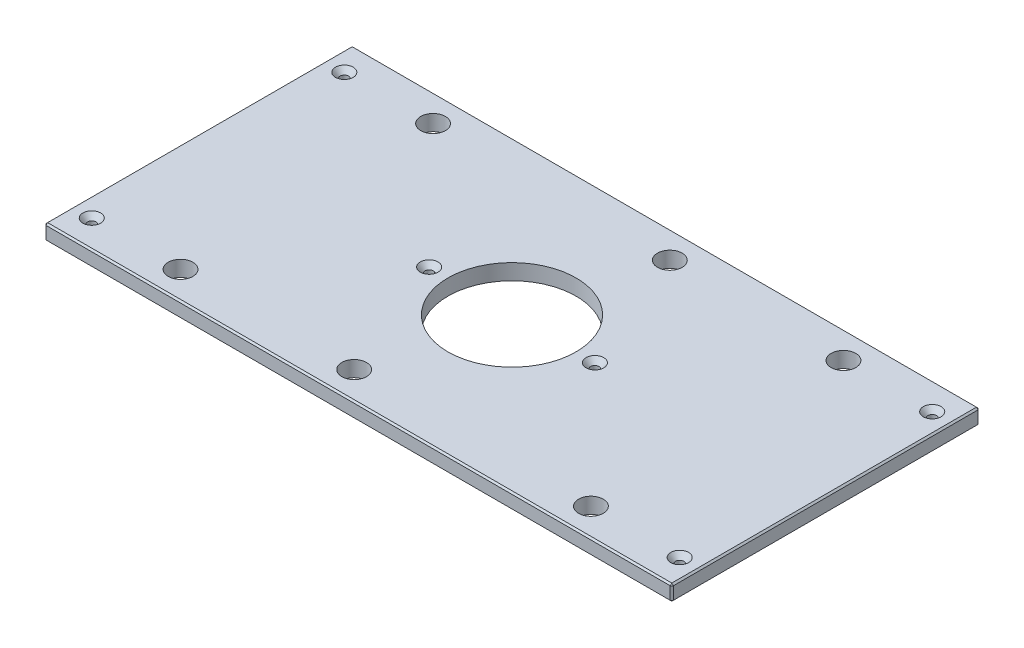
from build123d import *

# Parameters (mm, degrees)
SKETCH1_W                                        = 504.825
SKETCH1_H                                        = 247.65
BOSS_EXTRUDE1_DEPTH                              = 12.7
SKETCH13_R                                       = 51.562
CUT_EXTRUDE6_DEPTH                               = 282.435589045
F_25_32_0_78125_DIAMETER_HOLE1_D                 = 19.84375
CHAMFER2_SIZE                                    = 1.27
CSK_FOR_1_4_FLAT_HEAD_MACHINE_SCREW1_D           = 6.7564
CSK_FOR_1_4_FLAT_HEAD_MACHINE_SCREW1_CSINK_D     = 14.2748
CSK_FOR_1_4_FLAT_HEAD_MACHINE_SCREW1_CSINK_ANGLE = 82


with BuildPart() as part:
    # Sketch1 → Boss-Extrude1 (new body)
    with BuildSketch(Plane(origin=(0, 0, 0), x_dir=(1, 0, 0), z_dir=(0, 1, 0))):
        Rectangle(SKETCH1_W, SKETCH1_H)
    extrude(amount=BOSS_EXTRUDE1_DEPTH)

    # Sketch13 → Cut-Extrude6 (cut, through all)
    with BuildSketch(Plane(origin=(0, 12.7, 0), x_dir=(1, 0, 0), z_dir=(0, 1, 0))):
        with Locations(Location((0, 0, 0), (0, 0, 270))):
            Circle(SKETCH13_R)
    extrude(amount=-CUT_EXTRUDE6_DEPTH, mode=Mode.SUBTRACT)

    # 25_32 _0.78125_ Diameter Hole1 (through all)
    with Locations(Plane(origin=(0, 12.7, 0), x_dir=(1, 0, 0), z_dir=(0, 1, 0))):
        with Locations((165.1, 101.6), (-165.1, 101.6), (165.1, -101.6), (-165.1, -101.6), (25.4, 101.6), (-25.4, -101.6)):
            Hole(F_25_32_0_78125_DIAMETER_HOLE1_D / 2)

    # Chamfer2
    chamfer2_edges = [part.edges().sort_by_distance(p)[0] for p in [
        (252.4125, 12.7, 0),
        (0, 12.7, -123.825),
        (-252.4125, 12.7, 0),
        (0, 0, -123.825),
        (252.4125, 0, 0),
        (0, 0, 123.825),
        (-252.4125, 0, 0),
        (0, 12.7, 123.825),
        (-252.4125, 6.35, -123.825),
        (252.4125, 6.35, -123.825),
        (252.4125, 6.35, 123.825),
        (-252.4125, 6.35, 123.825),
    ]]
    chamfer(chamfer2_edges, length=CHAMFER2_SIZE)

    # CSK for 1_4 Flat Head Machine Screw1 (through all)
    with Locations(Plane(origin=(0, 12.7, 0), x_dir=(1, 0, 0), z_dir=(0, 1, 0))):
        with Locations((236.5375, 101.6), (236.5375, -101.6), (-236.5375, -101.6), (-66.675, 0), (66.675, 0), (-236.5375, 101.6), (-165.1, 101.6), (-165.1, -101.6)):
            CounterSinkHole(CSK_FOR_1_4_FLAT_HEAD_MACHINE_SCREW1_D / 2, CSK_FOR_1_4_FLAT_HEAD_MACHINE_SCREW1_CSINK_D / 2, counter_sink_angle=CSK_FOR_1_4_FLAT_HEAD_MACHINE_SCREW1_CSINK_ANGLE)


solid = part.part
